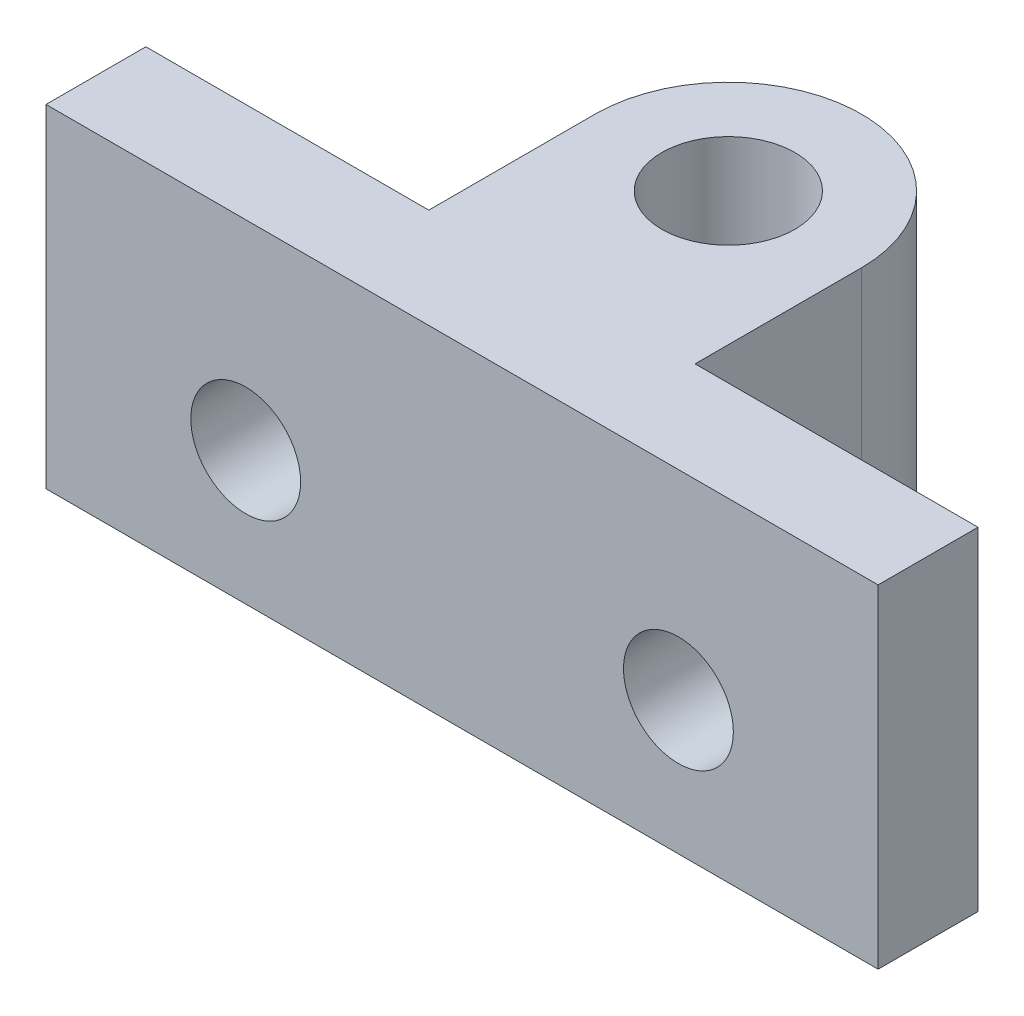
ISO-10303-21;
HEADER;
FILE_DESCRIPTION(('STEP AP214'),'2;1');
FILE_NAME('part.step','',(''),(''),'','','');
FILE_SCHEMA(('AUTOMOTIVE_DESIGN { 1 0 10303 214 1 1 1 1 }'));
ENDSEC;
DATA;
#1=APPLICATION_CONTEXT('core data for automotive mechanical design processes');
#2=APPLICATION_PROTOCOL_DEFINITION('international standard','automotive_design',2000,#1);
#3=PRODUCT_CONTEXT('',#1,'mechanical');
#4=PRODUCT('Part','Part','',(#3));
#5=PRODUCT_RELATED_PRODUCT_CATEGORY('part','',(#4));
#6=PRODUCT_DEFINITION_FORMATION('','',#4);
#7=PRODUCT_DEFINITION_CONTEXT('part definition',#1,'design');
#8=PRODUCT_DEFINITION('design','',#6,#7);
#9=PRODUCT_DEFINITION_SHAPE('','',#8);
#10=(LENGTH_UNIT() NAMED_UNIT(*) SI_UNIT(.MILLI.,.METRE.));
#11=(NAMED_UNIT(*) PLANE_ANGLE_UNIT() SI_UNIT($,.RADIAN.));
#12=(NAMED_UNIT(*) SI_UNIT($,.STERADIAN.) SOLID_ANGLE_UNIT());
#13=UNCERTAINTY_MEASURE_WITH_UNIT(LENGTH_MEASURE(1.E-05),#10,'distance_accuracy_value','');
#14=(GEOMETRIC_REPRESENTATION_CONTEXT(3) GLOBAL_UNCERTAINTY_ASSIGNED_CONTEXT((#13)) GLOBAL_UNIT_ASSIGNED_CONTEXT((#10,
#11,#12)) REPRESENTATION_CONTEXT('',''));
#15=CARTESIAN_POINT('',(0.,0.,0.));
#16=DIRECTION('',(0.,0.,1.));
#17=DIRECTION('',(1.,0.,0.));
#18=AXIS2_PLACEMENT_3D('',#15,#16,#17);
#19=CARTESIAN_POINT('',(16.5,10.,0.));
#20=DIRECTION('',(1.,0.,0.));
#21=DIRECTION('',(0.,0.,-1.));
#22=AXIS2_PLACEMENT_3D('',#19,#20,#21);
#23=PLANE('',#22);
#24=DIRECTION('',(0.,0.,1.));
#25=VECTOR('',#24,1.);
#26=CARTESIAN_POINT('',(16.5,0.,0.));
#27=LINE('',#26,#25);
#28=CARTESIAN_POINT('',(16.5,0.,-8.));
#29=VERTEX_POINT('',#28);
#30=CARTESIAN_POINT('',(16.5,0.,-3.));
#31=VERTEX_POINT('',#30);
#32=EDGE_CURVE('E135',#29,#31,#27,.T.);
#33=ORIENTED_EDGE('',*,*,#32,.F.);
#34=DIRECTION('',(0.,-1.,0.));
#35=VECTOR('',#34,1.);
#36=CARTESIAN_POINT('',(16.5,10.,-8.));
#37=LINE('',#36,#35);
#38=CARTESIAN_POINT('',(16.5,10.,-8.));
#39=VERTEX_POINT('',#38);
#40=EDGE_CURVE('E11',#39,#29,#37,.T.);
#41=ORIENTED_EDGE('',*,*,#40,.F.);
#42=DIRECTION('',(0.,0.,1.));
#43=VECTOR('',#42,1.);
#44=CARTESIAN_POINT('',(16.5,10.,0.));
#45=LINE('',#44,#43);
#46=CARTESIAN_POINT('',(16.5,10.,-3.));
#47=VERTEX_POINT('',#46);
#48=EDGE_CURVE('E155',#39,#47,#45,.T.);
#49=ORIENTED_EDGE('',*,*,#48,.T.);
#50=DIRECTION('',(0.,-1.,0.));
#51=VECTOR('',#50,1.);
#52=CARTESIAN_POINT('',(16.5,10.,-3.));
#53=LINE('',#52,#51);
#54=EDGE_CURVE('E52',#47,#31,#53,.T.);
#55=ORIENTED_EDGE('',*,*,#54,.T.);
#56=EDGE_LOOP('',(#33,#41,#49,#55));
#57=FACE_BOUND('',#56,.T.);
#58=ADVANCED_FACE('F35',(#57),#23,.T.);
#59=CARTESIAN_POINT('',(12.5,10.,-8.));
#60=DIRECTION('',(0.,-1.,0.));
#61=DIRECTION('',(0.,0.,-1.));
#62=AXIS2_PLACEMENT_3D('',#59,#60,#61);
#63=CYLINDRICAL_SURFACE('',#62,4.);
#64=CARTESIAN_POINT('',(12.5,0.,-8.));
#65=DIRECTION('',(0.,1.,0.));
#66=DIRECTION('',(0.,0.,1.));
#67=AXIS2_PLACEMENT_3D('',#64,#65,#66);
#68=CIRCLE('',#67,4.);
#69=CARTESIAN_POINT('',(8.5,0.,-8.));
#70=VERTEX_POINT('',#69);
#71=EDGE_CURVE('E137',#29,#70,#68,.T.);
#72=ORIENTED_EDGE('',*,*,#71,.T.);
#73=DIRECTION('',(0.,-1.,0.));
#74=VECTOR('',#73,1.);
#75=CARTESIAN_POINT('',(8.5,10.,-8.));
#76=LINE('',#75,#74);
#77=CARTESIAN_POINT('',(8.5,10.,-8.));
#78=VERTEX_POINT('',#77);
#79=EDGE_CURVE('E44',#78,#70,#76,.T.);
#80=ORIENTED_EDGE('',*,*,#79,.F.);
#81=CARTESIAN_POINT('',(12.5,10.,-8.));
#82=DIRECTION('',(0.,1.,0.));
#83=DIRECTION('',(0.,0.,1.));
#84=AXIS2_PLACEMENT_3D('',#81,#82,#83);
#85=CIRCLE('',#84,4.);
#86=EDGE_CURVE('E181',#39,#78,#85,.T.);
#87=ORIENTED_EDGE('',*,*,#86,.F.);
#88=ORIENTED_EDGE('',*,*,#40,.T.);
#89=EDGE_LOOP('',(#72,#80,#87,#88));
#90=FACE_BOUND('',#89,.T.);
#91=ADVANCED_FACE('F218',(#90),#63,.T.);
#92=CARTESIAN_POINT('',(8.5,10.,0.));
#93=DIRECTION('',(1.,0.,0.));
#94=DIRECTION('',(0.,0.,-1.));
#95=AXIS2_PLACEMENT_3D('',#92,#93,#94);
#96=PLANE('',#95);
#97=DIRECTION('',(0.,0.,1.));
#98=VECTOR('',#97,1.);
#99=CARTESIAN_POINT('',(8.5,0.,0.));
#100=LINE('',#99,#98);
#101=CARTESIAN_POINT('',(8.5,0.,-3.));
#102=VERTEX_POINT('',#101);
#103=EDGE_CURVE('E139',#70,#102,#100,.T.);
#104=ORIENTED_EDGE('',*,*,#103,.T.);
#105=DIRECTION('',(0.,-1.,0.));
#106=VECTOR('',#105,1.);
#107=CARTESIAN_POINT('',(8.5,10.,-3.));
#108=LINE('',#107,#106);
#109=CARTESIAN_POINT('',(8.5,10.,-3.));
#110=VERTEX_POINT('',#109);
#111=EDGE_CURVE('E161',#110,#102,#108,.T.);
#112=ORIENTED_EDGE('',*,*,#111,.F.);
#113=DIRECTION('',(0.,0.,1.));
#114=VECTOR('',#113,1.);
#115=CARTESIAN_POINT('',(8.5,10.,0.));
#116=LINE('',#115,#114);
#117=EDGE_CURVE('E170',#78,#110,#116,.T.);
#118=ORIENTED_EDGE('',*,*,#117,.F.);
#119=ORIENTED_EDGE('',*,*,#79,.T.);
#120=EDGE_LOOP('',(#104,#112,#118,#119));
#121=FACE_BOUND('',#120,.T.);
#122=ADVANCED_FACE('F168',(#121),#96,.F.);
#123=CARTESIAN_POINT('',(0.,10.,-3.));
#124=DIRECTION('',(0.,0.,-1.));
#125=DIRECTION('',(-1.,0.,0.));
#126=AXIS2_PLACEMENT_3D('',#123,#124,#125);
#127=PLANE('',#126);
#128=CARTESIAN_POINT('',(6.00000702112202,3.9999961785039,-3.));
#129=DIRECTION('',(0.,0.,-1.));
#130=DIRECTION('',(-1.,0.,0.));
#131=AXIS2_PLACEMENT_3D('',#128,#129,#130);
#132=CIRCLE('',#131,1.64999999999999);
#133=CARTESIAN_POINT('',(4.35000702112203,3.9999961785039,-3.));
#134=VERTEX_POINT('',#133);
#135=EDGE_CURVE('E189',#134,#134,#132,.T.);
#136=ORIENTED_EDGE('',*,*,#135,.F.);
#137=EDGE_LOOP('',(#136));
#138=FACE_BOUND('',#137,.T.);
#139=DIRECTION('',(1.,0.,0.));
#140=VECTOR('',#139,1.);
#141=CARTESIAN_POINT('',(0.,0.,-3.));
#142=LINE('',#141,#140);
#143=CARTESIAN_POINT('',(0.,0.,-3.));
#144=VERTEX_POINT('',#143);
#145=EDGE_CURVE('E142',#144,#102,#142,.T.);
#146=ORIENTED_EDGE('',*,*,#145,.F.);
#147=DIRECTION('',(0.,-1.,0.));
#148=VECTOR('',#147,1.);
#149=CARTESIAN_POINT('',(0.,10.,-3.));
#150=LINE('',#149,#148);
#151=CARTESIAN_POINT('',(0.,10.,-3.));
#152=VERTEX_POINT('',#151);
#153=EDGE_CURVE('E159',#152,#144,#150,.T.);
#154=ORIENTED_EDGE('',*,*,#153,.F.);
#155=DIRECTION('',(1.,0.,0.));
#156=VECTOR('',#155,1.);
#157=CARTESIAN_POINT('',(0.,10.,-3.));
#158=LINE('',#157,#156);
#159=EDGE_CURVE('E130',#152,#110,#158,.T.);
#160=ORIENTED_EDGE('',*,*,#159,.T.);
#161=ORIENTED_EDGE('',*,*,#111,.T.);
#162=EDGE_LOOP('',(#146,#154,#160,#161));
#163=FACE_BOUND('',#162,.T.);
#164=ADVANCED_FACE('F179',(#138,#163),#127,.T.);
#165=CARTESIAN_POINT('',(0.,10.,0.));
#166=DIRECTION('',(-1.,0.,0.));
#167=DIRECTION('',(0.,0.,1.));
#168=AXIS2_PLACEMENT_3D('',#165,#166,#167);
#169=PLANE('',#168);
#170=DIRECTION('',(0.,0.,-1.));
#171=VECTOR('',#170,1.);
#172=CARTESIAN_POINT('',(0.,0.,0.));
#173=LINE('',#172,#171);
#174=CARTESIAN_POINT('',(0.,0.,0.));
#175=VERTEX_POINT('',#174);
#176=EDGE_CURVE('E145',#175,#144,#173,.T.);
#177=ORIENTED_EDGE('',*,*,#176,.F.);
#178=DIRECTION('',(0.,-1.,0.));
#179=VECTOR('',#178,1.);
#180=CARTESIAN_POINT('',(0.,10.,0.));
#181=LINE('',#180,#179);
#182=CARTESIAN_POINT('',(0.,10.,0.));
#183=VERTEX_POINT('',#182);
#184=EDGE_CURVE('E123',#183,#175,#181,.T.);
#185=ORIENTED_EDGE('',*,*,#184,.F.);
#186=DIRECTION('',(0.,0.,-1.));
#187=VECTOR('',#186,1.);
#188=CARTESIAN_POINT('',(0.,10.,0.));
#189=LINE('',#188,#187);
#190=EDGE_CURVE('E113',#183,#152,#189,.T.);
#191=ORIENTED_EDGE('',*,*,#190,.T.);
#192=ORIENTED_EDGE('',*,*,#153,.T.);
#193=EDGE_LOOP('',(#177,#185,#191,#192));
#194=FACE_BOUND('',#193,.T.);
#195=ADVANCED_FACE('F200',(#194),#169,.T.);
#196=CARTESIAN_POINT('',(0.,10.,0.));
#197=DIRECTION('',(0.,0.,-1.));
#198=DIRECTION('',(-1.,0.,0.));
#199=AXIS2_PLACEMENT_3D('',#196,#197,#198);
#200=PLANE('',#199);
#201=CARTESIAN_POINT('',(6.00000702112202,3.9999961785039,0.));
#202=DIRECTION('',(0.,0.,1.));
#203=DIRECTION('',(1.,0.,0.));
#204=AXIS2_PLACEMENT_3D('',#201,#202,#203);
#205=CIRCLE('',#204,1.64999999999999);
#206=CARTESIAN_POINT('',(7.65000702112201,3.9999961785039,0.));
#207=VERTEX_POINT('',#206);
#208=EDGE_CURVE('E192',#207,#207,#205,.T.);
#209=ORIENTED_EDGE('',*,*,#208,.F.);
#210=EDGE_LOOP('',(#209));
#211=FACE_BOUND('',#210,.T.);
#212=CARTESIAN_POINT('',(19.000007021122,3.9999961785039,0.));
#213=DIRECTION('',(0.,0.,1.));
#214=DIRECTION('',(1.,0.,0.));
#215=AXIS2_PLACEMENT_3D('',#212,#213,#214);
#216=CIRCLE('',#215,1.64999999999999);
#217=CARTESIAN_POINT('',(20.650007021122,3.9999961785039,0.));
#218=VERTEX_POINT('',#217);
#219=EDGE_CURVE('E186',#218,#218,#216,.T.);
#220=ORIENTED_EDGE('',*,*,#219,.F.);
#221=EDGE_LOOP('',(#220));
#222=FACE_BOUND('',#221,.T.);
#223=DIRECTION('',(1.,0.,0.));
#224=VECTOR('',#223,1.);
#225=CARTESIAN_POINT('',(0.,0.,0.));
#226=LINE('',#225,#224);
#227=CARTESIAN_POINT('',(25.,0.,0.));
#228=VERTEX_POINT('',#227);
#229=EDGE_CURVE('E120',#175,#228,#226,.T.);
#230=ORIENTED_EDGE('',*,*,#229,.T.);
#231=DIRECTION('',(0.,-1.,0.));
#232=VECTOR('',#231,1.);
#233=CARTESIAN_POINT('',(25.,10.,0.));
#234=LINE('',#233,#232);
#235=CARTESIAN_POINT('',(25.,10.,0.));
#236=VERTEX_POINT('',#235);
#237=EDGE_CURVE('E117',#236,#228,#234,.T.);
#238=ORIENTED_EDGE('',*,*,#237,.F.);
#239=DIRECTION('',(1.,0.,0.));
#240=VECTOR('',#239,1.);
#241=CARTESIAN_POINT('',(0.,10.,0.));
#242=LINE('',#241,#240);
#243=EDGE_CURVE('E103',#183,#236,#242,.T.);
#244=ORIENTED_EDGE('',*,*,#243,.F.);
#245=ORIENTED_EDGE('',*,*,#184,.T.);
#246=EDGE_LOOP('',(#230,#238,#244,#245));
#247=FACE_BOUND('',#246,.T.);
#248=ADVANCED_FACE('F118',(#211,#222,#247),#200,.F.);
#249=CARTESIAN_POINT('',(25.,10.,0.));
#250=DIRECTION('',(-1.,0.,0.));
#251=DIRECTION('',(0.,0.,1.));
#252=AXIS2_PLACEMENT_3D('',#249,#250,#251);
#253=PLANE('',#252);
#254=DIRECTION('',(0.,0.,-1.));
#255=VECTOR('',#254,1.);
#256=CARTESIAN_POINT('',(25.,0.,0.));
#257=LINE('',#256,#255);
#258=CARTESIAN_POINT('',(25.,0.,-3.));
#259=VERTEX_POINT('',#258);
#260=EDGE_CURVE('E150',#228,#259,#257,.T.);
#261=ORIENTED_EDGE('',*,*,#260,.T.);
#262=DIRECTION('',(0.,-1.,0.));
#263=VECTOR('',#262,1.);
#264=CARTESIAN_POINT('',(25.,10.,-3.));
#265=LINE('',#264,#263);
#266=CARTESIAN_POINT('',(25.,10.,-3.));
#267=VERTEX_POINT('',#266);
#268=EDGE_CURVE('E78',#267,#259,#265,.T.);
#269=ORIENTED_EDGE('',*,*,#268,.F.);
#270=DIRECTION('',(0.,0.,-1.));
#271=VECTOR('',#270,1.);
#272=CARTESIAN_POINT('',(25.,10.,0.));
#273=LINE('',#272,#271);
#274=EDGE_CURVE('E110',#236,#267,#273,.T.);
#275=ORIENTED_EDGE('',*,*,#274,.F.);
#276=ORIENTED_EDGE('',*,*,#237,.T.);
#277=EDGE_LOOP('',(#261,#269,#275,#276));
#278=FACE_BOUND('',#277,.T.);
#279=ADVANCED_FACE('F125',(#278),#253,.F.);
#280=CARTESIAN_POINT('',(19.000007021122,3.9999961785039,-3.));
#281=DIRECTION('',(0.,0.,-1.));
#282=DIRECTION('',(-1.,0.,0.));
#283=AXIS2_PLACEMENT_3D('',#280,#281,#282);
#284=CIRCLE('',#283,1.64999999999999);
#285=CARTESIAN_POINT('',(17.350007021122,3.9999961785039,-3.));
#286=VERTEX_POINT('',#285);
#287=EDGE_CURVE('E38',#286,#286,#284,.T.);
#288=ORIENTED_EDGE('',*,*,#287,.F.);
#289=EDGE_LOOP('',(#288));
#290=FACE_BOUND('',#289,.T.);
#291=EDGE_CURVE('E146',#31,#259,#142,.T.);
#292=ORIENTED_EDGE('',*,*,#291,.F.);
#293=ORIENTED_EDGE('',*,*,#54,.F.);
#294=EDGE_CURVE('E126',#47,#267,#158,.T.);
#295=ORIENTED_EDGE('',*,*,#294,.T.);
#296=ORIENTED_EDGE('',*,*,#268,.T.);
#297=EDGE_LOOP('',(#292,#293,#295,#296));
#298=FACE_BOUND('',#297,.T.);
#299=ADVANCED_FACE('F223',(#290,#298),#127,.T.);
#300=CARTESIAN_POINT('',(12.5,10.,-8.));
#301=DIRECTION('',(0.,-1.,0.));
#302=DIRECTION('',(0.,0.,-1.));
#303=AXIS2_PLACEMENT_3D('',#300,#301,#302);
#304=CYLINDRICAL_SURFACE('',#303,2.);
#305=CARTESIAN_POINT('',(12.5,10.,-8.));
#306=DIRECTION('',(0.,1.,0.));
#307=DIRECTION('',(0.,0.,1.));
#308=AXIS2_PLACEMENT_3D('',#305,#306,#307);
#309=CIRCLE('',#308,2.);
#310=CARTESIAN_POINT('',(12.5,10.,-6.));
#311=VERTEX_POINT('',#310);
#312=EDGE_CURVE('E128',#311,#311,#309,.T.);
#313=ORIENTED_EDGE('',*,*,#312,.T.);
#314=EDGE_LOOP('',(#313));
#315=FACE_BOUND('',#314,.T.);
#316=CARTESIAN_POINT('',(12.5,0.,-8.));
#317=DIRECTION('',(0.,1.,0.));
#318=DIRECTION('',(0.,0.,1.));
#319=AXIS2_PLACEMENT_3D('',#316,#317,#318);
#320=CIRCLE('',#319,2.);
#321=CARTESIAN_POINT('',(12.5,0.,-6.));
#322=VERTEX_POINT('',#321);
#323=EDGE_CURVE('E152',#322,#322,#320,.T.);
#324=ORIENTED_EDGE('',*,*,#323,.F.);
#325=EDGE_LOOP('',(#324));
#326=FACE_BOUND('',#325,.T.);
#327=ADVANCED_FACE('F225',(#315,#326),#304,.F.);
#328=CARTESIAN_POINT('',(0.,10.,0.));
#329=DIRECTION('',(0.,1.,0.));
#330=DIRECTION('',(0.,0.,1.));
#331=AXIS2_PLACEMENT_3D('',#328,#329,#330);
#332=PLANE('',#331);
#333=ORIENTED_EDGE('',*,*,#48,.F.);
#334=ORIENTED_EDGE('',*,*,#86,.T.);
#335=ORIENTED_EDGE('',*,*,#117,.T.);
#336=ORIENTED_EDGE('',*,*,#159,.F.);
#337=ORIENTED_EDGE('',*,*,#190,.F.);
#338=ORIENTED_EDGE('',*,*,#243,.T.);
#339=ORIENTED_EDGE('',*,*,#274,.T.);
#340=ORIENTED_EDGE('',*,*,#294,.F.);
#341=EDGE_LOOP('',(#333,#334,#335,#336,#337,#338,#339,#340));
#342=FACE_BOUND('',#341,.T.);
#343=ORIENTED_EDGE('',*,*,#312,.F.);
#344=EDGE_LOOP('',(#343));
#345=FACE_BOUND('',#344,.T.);
#346=ADVANCED_FACE('F106',(#342,#345),#332,.T.);
#347=CARTESIAN_POINT('',(0.,0.,0.));
#348=DIRECTION('',(0.,1.,0.));
#349=DIRECTION('',(0.,0.,1.));
#350=AXIS2_PLACEMENT_3D('',#347,#348,#349);
#351=PLANE('',#350);
#352=ORIENTED_EDGE('',*,*,#32,.T.);
#353=ORIENTED_EDGE('',*,*,#291,.T.);
#354=ORIENTED_EDGE('',*,*,#260,.F.);
#355=ORIENTED_EDGE('',*,*,#229,.F.);
#356=ORIENTED_EDGE('',*,*,#176,.T.);
#357=ORIENTED_EDGE('',*,*,#145,.T.);
#358=ORIENTED_EDGE('',*,*,#103,.F.);
#359=ORIENTED_EDGE('',*,*,#71,.F.);
#360=EDGE_LOOP('',(#352,#353,#354,#355,#356,#357,#358,#359));
#361=FACE_BOUND('',#360,.T.);
#362=ORIENTED_EDGE('',*,*,#323,.T.);
#363=EDGE_LOOP('',(#362));
#364=FACE_BOUND('',#363,.T.);
#365=ADVANCED_FACE('F174',(#361,#364),#351,.F.);
#366=CARTESIAN_POINT('',(19.000007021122,3.9999961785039,0.));
#367=DIRECTION('',(0.,0.,1.));
#368=DIRECTION('',(1.,0.,0.));
#369=AXIS2_PLACEMENT_3D('',#366,#367,#368);
#370=CYLINDRICAL_SURFACE('',#369,1.64999999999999);
#371=ORIENTED_EDGE('',*,*,#287,.T.);
#372=EDGE_LOOP('',(#371));
#373=FACE_BOUND('',#372,.T.);
#374=ORIENTED_EDGE('',*,*,#219,.T.);
#375=EDGE_LOOP('',(#374));
#376=FACE_BOUND('',#375,.T.);
#377=ADVANCED_FACE('F204',(#373,#376),#370,.F.);
#378=CARTESIAN_POINT('',(6.00000702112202,3.9999961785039,0.));
#379=DIRECTION('',(0.,0.,1.));
#380=DIRECTION('',(1.,0.,0.));
#381=AXIS2_PLACEMENT_3D('',#378,#379,#380);
#382=CYLINDRICAL_SURFACE('',#381,1.64999999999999);
#383=ORIENTED_EDGE('',*,*,#135,.T.);
#384=EDGE_LOOP('',(#383));
#385=FACE_BOUND('',#384,.T.);
#386=ORIENTED_EDGE('',*,*,#208,.T.);
#387=EDGE_LOOP('',(#386));
#388=FACE_BOUND('',#387,.T.);
#389=ADVANCED_FACE('F196',(#385,#388),#382,.F.);
#390=CLOSED_SHELL('',(#58,#91,#122,#164,#195,#248,#279,#299,#327,#346,#365,#377,#389));
#391=MANIFOLD_SOLID_BREP('B2',#390);
#392=ADVANCED_BREP_SHAPE_REPRESENTATION('',(#18,#391),#14);
#393=SHAPE_DEFINITION_REPRESENTATION(#9,#392);
ENDSEC;
END-ISO-10303-21;
